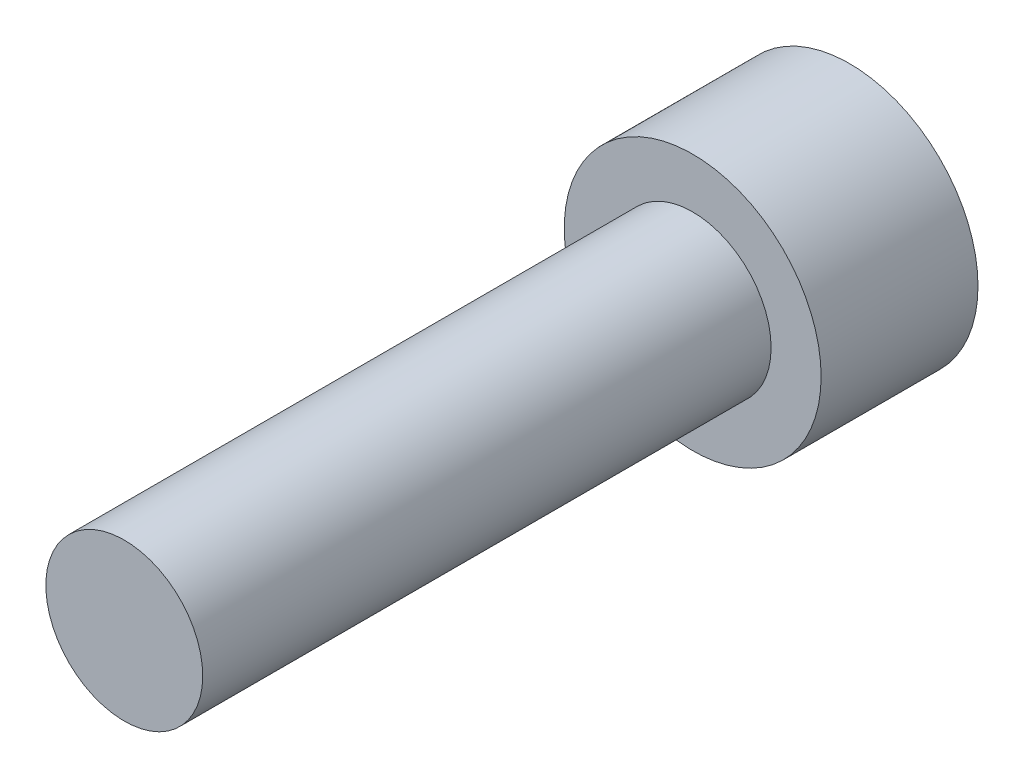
ISO-10303-21;
HEADER;
FILE_DESCRIPTION(('STEP AP214'),'2;1');
FILE_NAME('part.step','',(''),(''),'','','');
FILE_SCHEMA(('AUTOMOTIVE_DESIGN { 1 0 10303 214 1 1 1 1 }'));
ENDSEC;
DATA;
#1=APPLICATION_CONTEXT('core data for automotive mechanical design processes');
#2=APPLICATION_PROTOCOL_DEFINITION('international standard','automotive_design',2000,#1);
#3=PRODUCT_CONTEXT('',#1,'mechanical');
#4=PRODUCT('Part','Part','',(#3));
#5=PRODUCT_RELATED_PRODUCT_CATEGORY('part','',(#4));
#6=PRODUCT_DEFINITION_FORMATION('','',#4);
#7=PRODUCT_DEFINITION_CONTEXT('part definition',#1,'design');
#8=PRODUCT_DEFINITION('design','',#6,#7);
#9=PRODUCT_DEFINITION_SHAPE('','',#8);
#10=(LENGTH_UNIT() NAMED_UNIT(*) SI_UNIT(.MILLI.,.METRE.));
#11=(NAMED_UNIT(*) PLANE_ANGLE_UNIT() SI_UNIT($,.RADIAN.));
#12=(NAMED_UNIT(*) SI_UNIT($,.STERADIAN.) SOLID_ANGLE_UNIT());
#13=UNCERTAINTY_MEASURE_WITH_UNIT(LENGTH_MEASURE(1.E-05),#10,'distance_accuracy_value','');
#14=(GEOMETRIC_REPRESENTATION_CONTEXT(3) GLOBAL_UNCERTAINTY_ASSIGNED_CONTEXT((#13)) GLOBAL_UNIT_ASSIGNED_CONTEXT((#10,
#11,#12)) REPRESENTATION_CONTEXT('',''));
#15=CARTESIAN_POINT('',(0.,0.,0.));
#16=DIRECTION('',(0.,0.,1.));
#17=DIRECTION('',(1.,0.,0.));
#18=AXIS2_PLACEMENT_3D('',#15,#16,#17);
#19=CARTESIAN_POINT('',(0.,-2.8702,-3.5052));
#20=DIRECTION('',(0.,0.,-1.));
#21=DIRECTION('',(-1.,0.,0.));
#22=AXIS2_PLACEMENT_3D('',#19,#20,#21);
#23=PLANE('',#22);
#24=DIRECTION('',(0.866025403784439,-0.5,0.));
#25=VECTOR('',#24,1.);
#26=CARTESIAN_POINT('',(0.,1.5984519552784,-3.5052));
#27=LINE('',#26,#25);
#28=CARTESIAN_POINT('',(0.,1.5984519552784,-3.5052));
#29=VERTEX_POINT('',#28);
#30=CARTESIAN_POINT('',(1.3843,0.799225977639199,-3.5052));
#31=VERTEX_POINT('',#30);
#32=EDGE_CURVE('E51',#29,#31,#27,.T.);
#33=ORIENTED_EDGE('',*,*,#32,.F.);
#34=DIRECTION('',(0.866025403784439,0.5,0.));
#35=VECTOR('',#34,1.);
#36=CARTESIAN_POINT('',(-1.3843,0.7992259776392,-3.5052));
#37=LINE('',#36,#35);
#38=CARTESIAN_POINT('',(-1.3843,0.7992259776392,-3.5052));
#39=VERTEX_POINT('',#38);
#40=EDGE_CURVE('E134',#39,#29,#37,.T.);
#41=ORIENTED_EDGE('',*,*,#40,.F.);
#42=DIRECTION('',(0.,1.,0.));
#43=VECTOR('',#42,1.);
#44=CARTESIAN_POINT('',(-1.3843,-0.799225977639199,-3.5052));
#45=LINE('',#44,#43);
#46=CARTESIAN_POINT('',(-1.3843,-0.799225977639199,-3.5052));
#47=VERTEX_POINT('',#46);
#48=EDGE_CURVE('E132',#47,#39,#45,.T.);
#49=ORIENTED_EDGE('',*,*,#48,.F.);
#50=DIRECTION('',(-0.866025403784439,0.5,0.));
#51=VECTOR('',#50,1.);
#52=CARTESIAN_POINT('',(0.,-1.5984519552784,-3.5052));
#53=LINE('',#52,#51);
#54=CARTESIAN_POINT('',(0.,-1.5984519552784,-3.5052));
#55=VERTEX_POINT('',#54);
#56=EDGE_CURVE('E99',#55,#47,#53,.T.);
#57=ORIENTED_EDGE('',*,*,#56,.F.);
#58=DIRECTION('',(-0.866025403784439,-0.5,0.));
#59=VECTOR('',#58,1.);
#60=CARTESIAN_POINT('',(1.3843,-0.799225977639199,-3.5052));
#61=LINE('',#60,#59);
#62=CARTESIAN_POINT('',(1.3843,-0.799225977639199,-3.5052));
#63=VERTEX_POINT('',#62);
#64=EDGE_CURVE('E128',#63,#55,#61,.T.);
#65=ORIENTED_EDGE('',*,*,#64,.F.);
#66=DIRECTION('',(0.,-1.,0.));
#67=VECTOR('',#66,1.);
#68=CARTESIAN_POINT('',(1.3843,0.799225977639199,-3.5052));
#69=LINE('',#68,#67);
#70=EDGE_CURVE('E125',#31,#63,#69,.T.);
#71=ORIENTED_EDGE('',*,*,#70,.F.);
#72=EDGE_LOOP('',(#33,#41,#49,#57,#65,#71));
#73=FACE_BOUND('',#72,.T.);
#74=CARTESIAN_POINT('',(0.,0.,-3.5052));
#75=DIRECTION('',(0.,0.,1.));
#76=DIRECTION('',(1.,0.,0.));
#77=AXIS2_PLACEMENT_3D('',#74,#75,#76);
#78=CIRCLE('',#77,2.8702);
#79=CARTESIAN_POINT('',(2.8702,0.,-3.5052));
#80=VERTEX_POINT('',#79);
#81=EDGE_CURVE('E11',#80,#80,#78,.T.);
#82=ORIENTED_EDGE('',*,*,#81,.F.);
#83=EDGE_LOOP('',(#82));
#84=FACE_BOUND('',#83,.T.);
#85=ADVANCED_FACE('F37',(#73,#84),#23,.T.);
#86=CARTESIAN_POINT('',(0.,0.,12.7));
#87=DIRECTION('',(0.,0.,1.));
#88=DIRECTION('',(1.,0.,0.));
#89=AXIS2_PLACEMENT_3D('',#86,#87,#88);
#90=CYLINDRICAL_SURFACE('',#89,2.8702);
#91=ORIENTED_EDGE('',*,*,#81,.T.);
#92=EDGE_LOOP('',(#91));
#93=FACE_BOUND('',#92,.T.);
#94=CARTESIAN_POINT('',(0.,0.,0.));
#95=DIRECTION('',(0.,0.,1.));
#96=DIRECTION('',(1.,0.,0.));
#97=AXIS2_PLACEMENT_3D('',#94,#95,#96);
#98=CIRCLE('',#97,2.8702);
#99=CARTESIAN_POINT('',(2.8702,0.,0.));
#100=VERTEX_POINT('',#99);
#101=EDGE_CURVE('E44',#100,#100,#98,.T.);
#102=ORIENTED_EDGE('',*,*,#101,.F.);
#103=EDGE_LOOP('',(#102));
#104=FACE_BOUND('',#103,.T.);
#105=ADVANCED_FACE('F154',(#93,#104),#90,.T.);
#106=CARTESIAN_POINT('',(0.,-1.7526,0.));
#107=DIRECTION('',(0.,0.,1.));
#108=DIRECTION('',(1.,0.,0.));
#109=AXIS2_PLACEMENT_3D('',#106,#107,#108);
#110=PLANE('',#109);
#111=ORIENTED_EDGE('',*,*,#101,.T.);
#112=EDGE_LOOP('',(#111));
#113=FACE_BOUND('',#112,.T.);
#114=CARTESIAN_POINT('',(0.,0.,0.));
#115=DIRECTION('',(0.,0.,1.));
#116=DIRECTION('',(1.,0.,0.));
#117=AXIS2_PLACEMENT_3D('',#114,#115,#116);
#118=CIRCLE('',#117,1.7526);
#119=CARTESIAN_POINT('',(1.7526,0.,0.));
#120=VERTEX_POINT('',#119);
#121=EDGE_CURVE('E146',#120,#120,#118,.T.);
#122=ORIENTED_EDGE('',*,*,#121,.F.);
#123=EDGE_LOOP('',(#122));
#124=FACE_BOUND('',#123,.T.);
#125=ADVANCED_FACE('F151',(#113,#124),#110,.T.);
#126=CARTESIAN_POINT('',(0.,0.,12.7));
#127=DIRECTION('',(0.,0.,1.));
#128=DIRECTION('',(1.,0.,0.));
#129=AXIS2_PLACEMENT_3D('',#126,#127,#128);
#130=CYLINDRICAL_SURFACE('',#129,1.7526);
#131=ORIENTED_EDGE('',*,*,#121,.T.);
#132=EDGE_LOOP('',(#131));
#133=FACE_BOUND('',#132,.T.);
#134=CARTESIAN_POINT('',(0.,0.,12.7));
#135=DIRECTION('',(0.,0.,1.));
#136=DIRECTION('',(1.,0.,0.));
#137=AXIS2_PLACEMENT_3D('',#134,#135,#136);
#138=CIRCLE('',#137,1.7526);
#139=CARTESIAN_POINT('',(1.7526,0.,12.7));
#140=VERTEX_POINT('',#139);
#141=EDGE_CURVE('E138',#140,#140,#138,.T.);
#142=ORIENTED_EDGE('',*,*,#141,.F.);
#143=EDGE_LOOP('',(#142));
#144=FACE_BOUND('',#143,.T.);
#145=ADVANCED_FACE('F161',(#133,#144),#130,.T.);
#146=CARTESIAN_POINT('',(0.,0.,12.7));
#147=DIRECTION('',(0.,0.,1.));
#148=DIRECTION('',(1.,0.,0.));
#149=AXIS2_PLACEMENT_3D('',#146,#147,#148);
#150=PLANE('',#149);
#151=ORIENTED_EDGE('',*,*,#141,.T.);
#152=EDGE_LOOP('',(#151));
#153=FACE_BOUND('',#152,.T.);
#154=ADVANCED_FACE('F167',(#153),#150,.T.);
#155=CARTESIAN_POINT('',(0.,1.5984519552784,-1.4732));
#156=DIRECTION('',(0.5,0.866025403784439,0.));
#157=DIRECTION('',(-0.866025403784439,0.5,0.));
#158=AXIS2_PLACEMENT_3D('',#155,#156,#157);
#159=PLANE('',#158);
#160=ORIENTED_EDGE('',*,*,#32,.T.);
#161=DIRECTION('',(0.,0.,-1.));
#162=VECTOR('',#161,1.);
#163=CARTESIAN_POINT('',(1.3843,0.799225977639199,-1.4732));
#164=LINE('',#163,#162);
#165=CARTESIAN_POINT('',(1.3843,0.799225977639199,-1.4732));
#166=VERTEX_POINT('',#165);
#167=EDGE_CURVE('E81',#166,#31,#164,.T.);
#168=ORIENTED_EDGE('',*,*,#167,.F.);
#169=DIRECTION('',(0.866025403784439,-0.5,0.));
#170=VECTOR('',#169,1.);
#171=CARTESIAN_POINT('',(0.,1.5984519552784,-1.4732));
#172=LINE('',#171,#170);
#173=CARTESIAN_POINT('',(0.,1.5984519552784,-1.4732));
#174=VERTEX_POINT('',#173);
#175=EDGE_CURVE('E136',#174,#166,#172,.T.);
#176=ORIENTED_EDGE('',*,*,#175,.F.);
#177=DIRECTION('',(0.,0.,-1.));
#178=VECTOR('',#177,1.);
#179=CARTESIAN_POINT('',(0.,1.5984519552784,-1.4732));
#180=LINE('',#179,#178);
#181=EDGE_CURVE('E59',#174,#29,#180,.T.);
#182=ORIENTED_EDGE('',*,*,#181,.T.);
#183=EDGE_LOOP('',(#160,#168,#176,#182));
#184=FACE_BOUND('',#183,.T.);
#185=ADVANCED_FACE('F171',(#184),#159,.F.);
#186=CARTESIAN_POINT('',(-1.3843,0.7992259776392,-1.4732));
#187=DIRECTION('',(-0.5,0.866025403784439,0.));
#188=DIRECTION('',(-0.866025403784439,-0.5,0.));
#189=AXIS2_PLACEMENT_3D('',#186,#187,#188);
#190=PLANE('',#189);
#191=ORIENTED_EDGE('',*,*,#40,.T.);
#192=ORIENTED_EDGE('',*,*,#181,.F.);
#193=DIRECTION('',(0.866025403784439,0.5,0.));
#194=VECTOR('',#193,1.);
#195=CARTESIAN_POINT('',(-1.3843,0.7992259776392,-1.4732));
#196=LINE('',#195,#194);
#197=CARTESIAN_POINT('',(-1.3843,0.7992259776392,-1.4732));
#198=VERTEX_POINT('',#197);
#199=EDGE_CURVE('E111',#198,#174,#196,.T.);
#200=ORIENTED_EDGE('',*,*,#199,.F.);
#201=DIRECTION('',(0.,0.,-1.));
#202=VECTOR('',#201,1.);
#203=CARTESIAN_POINT('',(-1.3843,0.7992259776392,-1.4732));
#204=LINE('',#203,#202);
#205=EDGE_CURVE('E103',#198,#39,#204,.T.);
#206=ORIENTED_EDGE('',*,*,#205,.T.);
#207=EDGE_LOOP('',(#191,#192,#200,#206));
#208=FACE_BOUND('',#207,.T.);
#209=ADVANCED_FACE('F175',(#208),#190,.F.);
#210=CARTESIAN_POINT('',(-1.3843,-0.799225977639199,-1.4732));
#211=DIRECTION('',(-1.,0.,0.));
#212=DIRECTION('',(0.,0.,1.));
#213=AXIS2_PLACEMENT_3D('',#210,#211,#212);
#214=PLANE('',#213);
#215=ORIENTED_EDGE('',*,*,#48,.T.);
#216=ORIENTED_EDGE('',*,*,#205,.F.);
#217=DIRECTION('',(0.,1.,0.));
#218=VECTOR('',#217,1.);
#219=CARTESIAN_POINT('',(-1.3843,-0.799225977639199,-1.4732));
#220=LINE('',#219,#218);
#221=CARTESIAN_POINT('',(-1.3843,-0.799225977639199,-1.4732));
#222=VERTEX_POINT('',#221);
#223=EDGE_CURVE('E107',#222,#198,#220,.T.);
#224=ORIENTED_EDGE('',*,*,#223,.F.);
#225=DIRECTION('',(0.,0.,-1.));
#226=VECTOR('',#225,1.);
#227=CARTESIAN_POINT('',(-1.3843,-0.799225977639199,-1.4732));
#228=LINE('',#227,#226);
#229=EDGE_CURVE('E92',#222,#47,#228,.T.);
#230=ORIENTED_EDGE('',*,*,#229,.T.);
#231=EDGE_LOOP('',(#215,#216,#224,#230));
#232=FACE_BOUND('',#231,.T.);
#233=ADVANCED_FACE('F108',(#232),#214,.F.);
#234=CARTESIAN_POINT('',(0.,-1.5984519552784,-1.4732));
#235=DIRECTION('',(-0.5,-0.866025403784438,0.));
#236=DIRECTION('',(0.866025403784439,-0.5,0.));
#237=AXIS2_PLACEMENT_3D('',#234,#235,#236);
#238=PLANE('',#237);
#239=ORIENTED_EDGE('',*,*,#56,.T.);
#240=ORIENTED_EDGE('',*,*,#229,.F.);
#241=DIRECTION('',(-0.866025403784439,0.5,0.));
#242=VECTOR('',#241,1.);
#243=CARTESIAN_POINT('',(0.,-1.5984519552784,-1.4732));
#244=LINE('',#243,#242);
#245=CARTESIAN_POINT('',(0.,-1.5984519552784,-1.4732));
#246=VERTEX_POINT('',#245);
#247=EDGE_CURVE('E96',#246,#222,#244,.T.);
#248=ORIENTED_EDGE('',*,*,#247,.F.);
#249=DIRECTION('',(0.,0.,-1.));
#250=VECTOR('',#249,1.);
#251=CARTESIAN_POINT('',(0.,-1.5984519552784,-1.4732));
#252=LINE('',#251,#250);
#253=EDGE_CURVE('E104',#246,#55,#252,.T.);
#254=ORIENTED_EDGE('',*,*,#253,.T.);
#255=EDGE_LOOP('',(#239,#240,#248,#254));
#256=FACE_BOUND('',#255,.T.);
#257=ADVANCED_FACE('F94',(#256),#238,.F.);
#258=CARTESIAN_POINT('',(1.3843,-0.799225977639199,-1.4732));
#259=DIRECTION('',(0.5,-0.866025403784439,0.));
#260=DIRECTION('',(0.866025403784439,0.5,0.));
#261=AXIS2_PLACEMENT_3D('',#258,#259,#260);
#262=PLANE('',#261);
#263=ORIENTED_EDGE('',*,*,#64,.T.);
#264=ORIENTED_EDGE('',*,*,#253,.F.);
#265=DIRECTION('',(-0.866025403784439,-0.5,0.));
#266=VECTOR('',#265,1.);
#267=CARTESIAN_POINT('',(1.3843,-0.799225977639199,-1.4732));
#268=LINE('',#267,#266);
#269=CARTESIAN_POINT('',(1.3843,-0.799225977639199,-1.4732));
#270=VERTEX_POINT('',#269);
#271=EDGE_CURVE('E117',#270,#246,#268,.T.);
#272=ORIENTED_EDGE('',*,*,#271,.F.);
#273=DIRECTION('',(0.,0.,-1.));
#274=VECTOR('',#273,1.);
#275=CARTESIAN_POINT('',(1.3843,-0.799225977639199,-1.4732));
#276=LINE('',#275,#274);
#277=EDGE_CURVE('E141',#270,#63,#276,.T.);
#278=ORIENTED_EDGE('',*,*,#277,.T.);
#279=EDGE_LOOP('',(#263,#264,#272,#278));
#280=FACE_BOUND('',#279,.T.);
#281=ADVANCED_FACE('F179',(#280),#262,.F.);
#282=CARTESIAN_POINT('',(1.3843,0.799225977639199,-1.4732));
#283=DIRECTION('',(1.,0.,0.));
#284=DIRECTION('',(0.,1.,0.));
#285=AXIS2_PLACEMENT_3D('',#282,#283,#284);
#286=PLANE('',#285);
#287=ORIENTED_EDGE('',*,*,#70,.T.);
#288=ORIENTED_EDGE('',*,*,#277,.F.);
#289=DIRECTION('',(0.,-1.,0.));
#290=VECTOR('',#289,1.);
#291=CARTESIAN_POINT('',(1.3843,0.799225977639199,-1.4732));
#292=LINE('',#291,#290);
#293=EDGE_CURVE('E119',#166,#270,#292,.T.);
#294=ORIENTED_EDGE('',*,*,#293,.F.);
#295=ORIENTED_EDGE('',*,*,#167,.T.);
#296=EDGE_LOOP('',(#287,#288,#294,#295));
#297=FACE_BOUND('',#296,.T.);
#298=ADVANCED_FACE('F176',(#297),#286,.F.);
#299=CARTESIAN_POINT('',(1.3843,0.799225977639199,-1.4732));
#300=DIRECTION('',(0.,0.,-1.));
#301=DIRECTION('',(-1.,0.,0.));
#302=AXIS2_PLACEMENT_3D('',#299,#300,#301);
#303=PLANE('',#302);
#304=ORIENTED_EDGE('',*,*,#175,.T.);
#305=ORIENTED_EDGE('',*,*,#293,.T.);
#306=ORIENTED_EDGE('',*,*,#271,.T.);
#307=ORIENTED_EDGE('',*,*,#247,.T.);
#308=ORIENTED_EDGE('',*,*,#223,.T.);
#309=ORIENTED_EDGE('',*,*,#199,.T.);
#310=EDGE_LOOP('',(#304,#305,#306,#307,#308,#309));
#311=FACE_BOUND('',#310,.T.);
#312=ADVANCED_FACE('F114',(#311),#303,.T.);
#313=CLOSED_SHELL('',(#85,#105,#125,#145,#154,#185,#209,#233,#257,#281,#298,#312));
#314=MANIFOLD_SOLID_BREP('B2',#313);
#315=ADVANCED_BREP_SHAPE_REPRESENTATION('',(#18,#314),#14);
#316=SHAPE_DEFINITION_REPRESENTATION(#9,#315);
ENDSEC;
END-ISO-10303-21;
